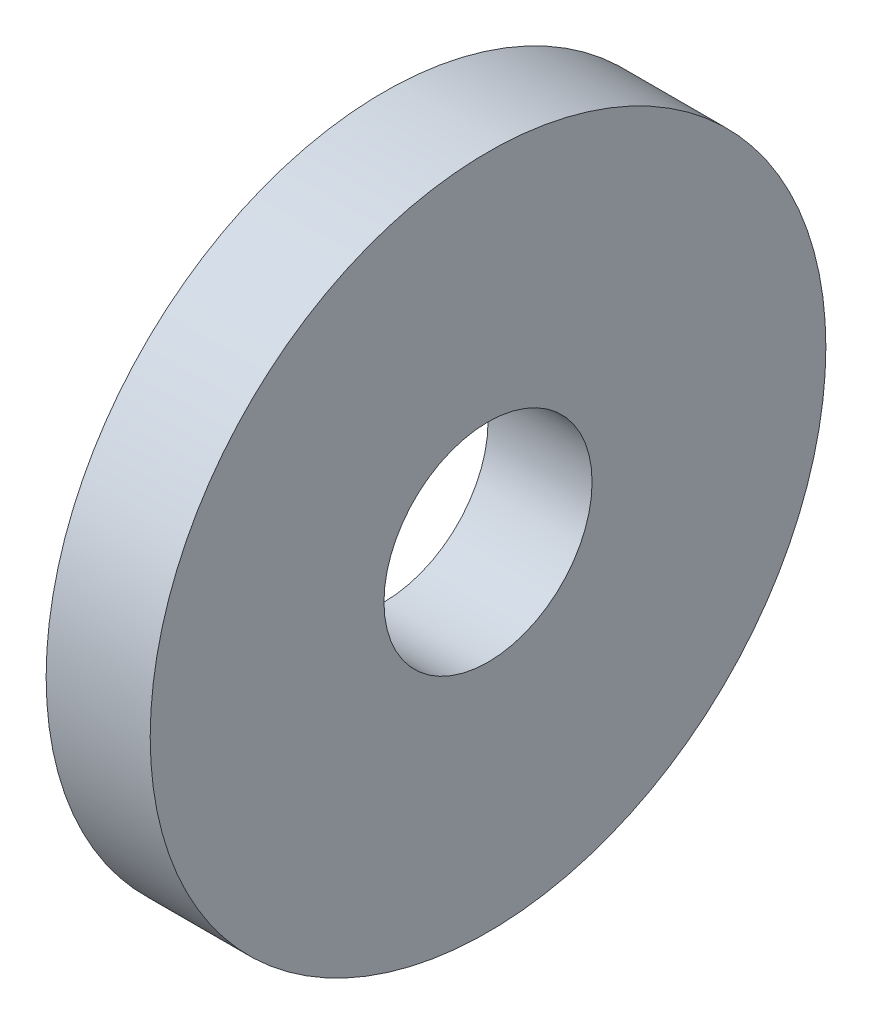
ISO-10303-21;
HEADER;
FILE_DESCRIPTION(('STEP AP214'),'2;1');
FILE_NAME('part.step','',(''),(''),'','','');
FILE_SCHEMA(('AUTOMOTIVE_DESIGN { 1 0 10303 214 1 1 1 1 }'));
ENDSEC;
DATA;
#1=APPLICATION_CONTEXT('core data for automotive mechanical design processes');
#2=APPLICATION_PROTOCOL_DEFINITION('international standard','automotive_design',2000,#1);
#3=PRODUCT_CONTEXT('',#1,'mechanical');
#4=PRODUCT('Part','Part','',(#3));
#5=PRODUCT_RELATED_PRODUCT_CATEGORY('part','',(#4));
#6=PRODUCT_DEFINITION_FORMATION('','',#4);
#7=PRODUCT_DEFINITION_CONTEXT('part definition',#1,'design');
#8=PRODUCT_DEFINITION('design','',#6,#7);
#9=PRODUCT_DEFINITION_SHAPE('','',#8);
#10=(LENGTH_UNIT() NAMED_UNIT(*) SI_UNIT(.MILLI.,.METRE.));
#11=(NAMED_UNIT(*) PLANE_ANGLE_UNIT() SI_UNIT($,.RADIAN.));
#12=(NAMED_UNIT(*) SI_UNIT($,.STERADIAN.) SOLID_ANGLE_UNIT());
#13=UNCERTAINTY_MEASURE_WITH_UNIT(LENGTH_MEASURE(1.E-05),#10,'distance_accuracy_value','');
#14=(GEOMETRIC_REPRESENTATION_CONTEXT(3) GLOBAL_UNCERTAINTY_ASSIGNED_CONTEXT((#13)) GLOBAL_UNIT_ASSIGNED_CONTEXT((#10,
#11,#12)) REPRESENTATION_CONTEXT('',''));
#15=CARTESIAN_POINT('',(0.,0.,0.));
#16=DIRECTION('',(0.,0.,1.));
#17=DIRECTION('',(1.,0.,0.));
#18=AXIS2_PLACEMENT_3D('',#15,#16,#17);
#19=CARTESIAN_POINT('',(3.,0.,0.));
#20=DIRECTION('',(1.,0.,0.));
#21=DIRECTION('',(0.,0.,-1.));
#22=AXIS2_PLACEMENT_3D('',#19,#20,#21);
#23=PLANE('',#22);
#24=CARTESIAN_POINT('',(3.,0.,0.));
#25=DIRECTION('',(1.,0.,0.));
#26=DIRECTION('',(0.,0.,-1.));
#27=AXIS2_PLACEMENT_3D('',#24,#25,#26);
#28=CIRCLE('',#27,9.74);
#29=CARTESIAN_POINT('',(3.,0.,-9.74));
#30=VERTEX_POINT('',#29);
#31=EDGE_CURVE('E10',#30,#30,#28,.T.);
#32=ORIENTED_EDGE('',*,*,#31,.T.);
#33=EDGE_LOOP('',(#32));
#34=FACE_BOUND('',#33,.T.);
#35=CARTESIAN_POINT('',(3.,0.,0.));
#36=DIRECTION('',(1.,0.,0.));
#37=DIRECTION('',(0.,0.,-1.));
#38=AXIS2_PLACEMENT_3D('',#35,#36,#37);
#39=CIRCLE('',#38,3.);
#40=CARTESIAN_POINT('',(3.,0.,-3.));
#41=VERTEX_POINT('',#40);
#42=EDGE_CURVE('E43',#41,#41,#39,.T.);
#43=ORIENTED_EDGE('',*,*,#42,.F.);
#44=EDGE_LOOP('',(#43));
#45=FACE_BOUND('',#44,.T.);
#46=ADVANCED_FACE('F32',(#34,#45),#23,.T.);
#47=CARTESIAN_POINT('',(0.,0.,0.));
#48=DIRECTION('',(1.,0.,0.));
#49=DIRECTION('',(0.,0.,-1.));
#50=AXIS2_PLACEMENT_3D('',#47,#48,#49);
#51=PLANE('',#50);
#52=CARTESIAN_POINT('',(0.,0.,0.));
#53=DIRECTION('',(1.,0.,0.));
#54=DIRECTION('',(0.,0.,-1.));
#55=AXIS2_PLACEMENT_3D('',#52,#53,#54);
#56=CIRCLE('',#55,9.74);
#57=CARTESIAN_POINT('',(0.,0.,-9.74));
#58=VERTEX_POINT('',#57);
#59=EDGE_CURVE('E36',#58,#58,#56,.T.);
#60=ORIENTED_EDGE('',*,*,#59,.F.);
#61=EDGE_LOOP('',(#60));
#62=FACE_BOUND('',#61,.T.);
#63=CARTESIAN_POINT('',(0.,0.,0.));
#64=DIRECTION('',(1.,0.,0.));
#65=DIRECTION('',(0.,0.,-1.));
#66=AXIS2_PLACEMENT_3D('',#63,#64,#65);
#67=CIRCLE('',#66,3.);
#68=CARTESIAN_POINT('',(0.,0.,-3.));
#69=VERTEX_POINT('',#68);
#70=EDGE_CURVE('E45',#69,#69,#67,.T.);
#71=ORIENTED_EDGE('',*,*,#70,.T.);
#72=EDGE_LOOP('',(#71));
#73=FACE_BOUND('',#72,.T.);
#74=ADVANCED_FACE('F55',(#62,#73),#51,.F.);
#75=CARTESIAN_POINT('',(3.,0.,0.));
#76=DIRECTION('',(-1.,0.,0.));
#77=DIRECTION('',(0.,0.,1.));
#78=AXIS2_PLACEMENT_3D('',#75,#76,#77);
#79=CYLINDRICAL_SURFACE('',#78,9.74);
#80=ORIENTED_EDGE('',*,*,#31,.F.);
#81=EDGE_LOOP('',(#80));
#82=FACE_BOUND('',#81,.T.);
#83=ORIENTED_EDGE('',*,*,#59,.T.);
#84=EDGE_LOOP('',(#83));
#85=FACE_BOUND('',#84,.T.);
#86=ADVANCED_FACE('F34',(#82,#85),#79,.T.);
#87=CARTESIAN_POINT('',(3.,0.,0.));
#88=DIRECTION('',(-1.,0.,0.));
#89=DIRECTION('',(0.,0.,1.));
#90=AXIS2_PLACEMENT_3D('',#87,#88,#89);
#91=CYLINDRICAL_SURFACE('',#90,3.);
#92=ORIENTED_EDGE('',*,*,#42,.T.);
#93=EDGE_LOOP('',(#92));
#94=FACE_BOUND('',#93,.T.);
#95=ORIENTED_EDGE('',*,*,#70,.F.);
#96=EDGE_LOOP('',(#95));
#97=FACE_BOUND('',#96,.T.);
#98=ADVANCED_FACE('F51',(#94,#97),#91,.F.);
#99=CLOSED_SHELL('',(#46,#74,#86,#98));
#100=MANIFOLD_SOLID_BREP('B2',#99);
#101=ADVANCED_BREP_SHAPE_REPRESENTATION('',(#18,#100),#14);
#102=SHAPE_DEFINITION_REPRESENTATION(#9,#101);
ENDSEC;
END-ISO-10303-21;
